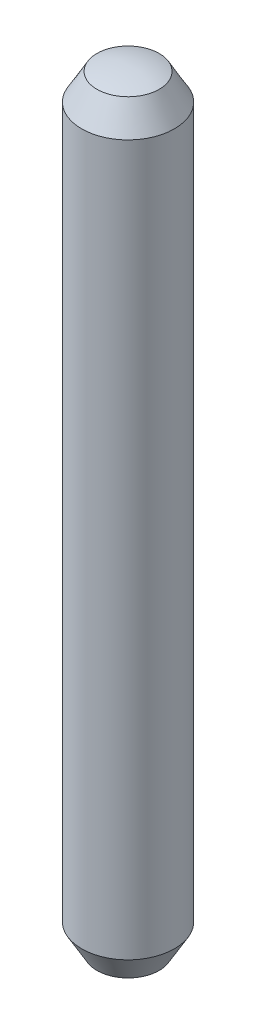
ISO-10303-21;
HEADER;
FILE_DESCRIPTION(('STEP AP214'),'2;1');
FILE_NAME('part.step','',(''),(''),'','','');
FILE_SCHEMA(('AUTOMOTIVE_DESIGN { 1 0 10303 214 1 1 1 1 }'));
ENDSEC;
DATA;
#1=APPLICATION_CONTEXT('core data for automotive mechanical design processes');
#2=APPLICATION_PROTOCOL_DEFINITION('international standard','automotive_design',2000,#1);
#3=PRODUCT_CONTEXT('',#1,'mechanical');
#4=PRODUCT('Part','Part','',(#3));
#5=PRODUCT_RELATED_PRODUCT_CATEGORY('part','',(#4));
#6=PRODUCT_DEFINITION_FORMATION('','',#4);
#7=PRODUCT_DEFINITION_CONTEXT('part definition',#1,'design');
#8=PRODUCT_DEFINITION('design','',#6,#7);
#9=PRODUCT_DEFINITION_SHAPE('','',#8);
#10=(LENGTH_UNIT() NAMED_UNIT(*) SI_UNIT(.MILLI.,.METRE.));
#11=(NAMED_UNIT(*) PLANE_ANGLE_UNIT() SI_UNIT($,.RADIAN.));
#12=(NAMED_UNIT(*) SI_UNIT($,.STERADIAN.) SOLID_ANGLE_UNIT());
#13=UNCERTAINTY_MEASURE_WITH_UNIT(LENGTH_MEASURE(1.E-05),#10,'distance_accuracy_value','');
#14=(GEOMETRIC_REPRESENTATION_CONTEXT(3) GLOBAL_UNCERTAINTY_ASSIGNED_CONTEXT((#13)) GLOBAL_UNIT_ASSIGNED_CONTEXT((#10,
#11,#12)) REPRESENTATION_CONTEXT('',''));
#15=CARTESIAN_POINT('',(0.,0.,0.));
#16=DIRECTION('',(0.,0.,1.));
#17=DIRECTION('',(1.,0.,0.));
#18=AXIS2_PLACEMENT_3D('',#15,#16,#17);
#19=CARTESIAN_POINT('',(0.,6.,0.));
#20=DIRECTION('',(-1.,0.,0.));
#21=DIRECTION('',(0.,-0.939980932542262,-0.341226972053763));
#22=AXIS2_PLACEMENT_3D('',#19,#20,#21);
#23=SPHERICAL_SURFACE('',#22,6.);
#24=CARTESIAN_POINT('',(0.,6.,0.));
#25=DIRECTION('',(0.,1.,0.));
#26=DIRECTION('',(-1.,0.,0.));
#27=AXIS2_PLACEMENT_3D('',#24,#25,#26);
#28=SPHERICAL_SURFACE('',#27,6.);
#29=CARTESIAN_POINT('',(0.,0.346782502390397,0.));
#30=DIRECTION('',(0.,1.,0.));
#31=DIRECTION('',(-1.,0.,0.));
#32=AXIS2_PLACEMENT_3D('',#29,#30,#31);
#33=CIRCLE('',#32,2.01025668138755);
#34=CARTESIAN_POINT('',(-2.01025668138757,0.346782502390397,0.));
#35=VERTEX_POINT('',#34);
#36=EDGE_CURVE('E19',#35,#35,#33,.T.);
#37=ORIENTED_EDGE('',*,*,#36,.F.);
#38=EDGE_LOOP('',(#37));
#39=FACE_BOUND('',#38,.T.);
#40=ADVANCED_FACE('F15',(#39),#28,.T.);
#41=CARTESIAN_POINT('',(0.,44.,0.));
#42=DIRECTION('',(-1.,0.,0.));
#43=DIRECTION('',(0.,0.941514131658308,0.336973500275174));
#44=AXIS2_PLACEMENT_3D('',#41,#42,#43);
#45=SPHERICAL_SURFACE('',#44,5.99999999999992);
#46=CARTESIAN_POINT('',(0.,44.,0.));
#47=DIRECTION('',(0.,-1.,0.));
#48=DIRECTION('',(0.,0.,-1.));
#49=AXIS2_PLACEMENT_3D('',#46,#47,#48);
#50=SPHERICAL_SURFACE('',#49,5.99999999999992);
#51=CARTESIAN_POINT('',(0.,49.653217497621,0.));
#52=DIRECTION('',(0.,-1.,0.));
#53=DIRECTION('',(0.,0.,-1.));
#54=AXIS2_PLACEMENT_3D('',#51,#52,#53);
#55=CIRCLE('',#54,2.01025668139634);
#56=CARTESIAN_POINT('',(0.,49.653217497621,-2.01025668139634));
#57=VERTEX_POINT('',#56);
#58=EDGE_CURVE('E28',#57,#57,#55,.T.);
#59=ORIENTED_EDGE('',*,*,#58,.F.);
#60=EDGE_LOOP('',(#59));
#61=FACE_BOUND('',#60,.T.);
#62=ADVANCED_FACE('F17',(#61),#50,.T.);
#63=CARTESIAN_POINT('',(0.,2.06106821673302,0.));
#64=DIRECTION('',(0.,1.,0.));
#65=DIRECTION('',(-1.,0.,0.));
#66=AXIS2_PLACEMENT_3D('',#63,#64,#65);
#67=CONICAL_SURFACE('',#66,3.00000000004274,0.523598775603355);
#68=CARTESIAN_POINT('',(0.,2.06106821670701,0.));
#69=DIRECTION('',(0.,-1.,0.));
#70=DIRECTION('',(1.,0.,0.));
#71=AXIS2_PLACEMENT_3D('',#68,#69,#70);
#72=CIRCLE('',#71,3.);
#73=CARTESIAN_POINT('',(3.,2.06106821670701,0.));
#74=VERTEX_POINT('',#73);
#75=EDGE_CURVE('E10',#74,#74,#72,.F.);
#76=ORIENTED_EDGE('',*,*,#75,.F.);
#77=EDGE_LOOP('',(#76));
#78=FACE_BOUND('',#77,.T.);
#79=ORIENTED_EDGE('',*,*,#36,.T.);
#80=EDGE_LOOP('',(#79));
#81=FACE_BOUND('',#80,.T.);
#82=ADVANCED_FACE('F36',(#78,#81),#67,.T.);
#83=CARTESIAN_POINT('',(0.,47.9389317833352,0.));
#84=DIRECTION('',(0.,-1.,0.));
#85=DIRECTION('',(0.,0.,-1.));
#86=AXIS2_PLACEMENT_3D('',#83,#84,#85);
#87=CONICAL_SURFACE('',#86,2.99999999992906,0.523598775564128);
#88=CARTESIAN_POINT('',(0.,47.938931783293,0.));
#89=DIRECTION('',(0.,-1.,0.));
#90=DIRECTION('',(1.,0.,0.));
#91=AXIS2_PLACEMENT_3D('',#88,#89,#90);
#92=CIRCLE('',#91,3.);
#93=CARTESIAN_POINT('',(2.99999999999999,47.938931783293,0.));
#94=VERTEX_POINT('',#93);
#95=EDGE_CURVE('E23',#94,#94,#92,.T.);
#96=ORIENTED_EDGE('',*,*,#95,.F.);
#97=EDGE_LOOP('',(#96));
#98=FACE_BOUND('',#97,.T.);
#99=ORIENTED_EDGE('',*,*,#58,.T.);
#100=EDGE_LOOP('',(#99));
#101=FACE_BOUND('',#100,.T.);
#102=ADVANCED_FACE('F48',(#98,#101),#87,.T.);
#103=CARTESIAN_POINT('',(0.,0.,0.));
#104=DIRECTION('',(0.,-1.,0.));
#105=DIRECTION('',(1.,0.,0.));
#106=AXIS2_PLACEMENT_3D('',#103,#104,#105);
#107=CYLINDRICAL_SURFACE('',#106,3.);
#108=ORIENTED_EDGE('',*,*,#75,.T.);
#109=EDGE_LOOP('',(#108));
#110=FACE_BOUND('',#109,.T.);
#111=ORIENTED_EDGE('',*,*,#95,.T.);
#112=EDGE_LOOP('',(#111));
#113=FACE_BOUND('',#112,.T.);
#114=ADVANCED_FACE('F46',(#110,#113),#107,.T.);
#115=CLOSED_SHELL('',(#40,#62,#82,#102,#114));
#116=MANIFOLD_SOLID_BREP('B1',#115);
#117=ADVANCED_BREP_SHAPE_REPRESENTATION('',(#18,#116),#14);
#118=SHAPE_DEFINITION_REPRESENTATION(#9,#117);
ENDSEC;
END-ISO-10303-21;
